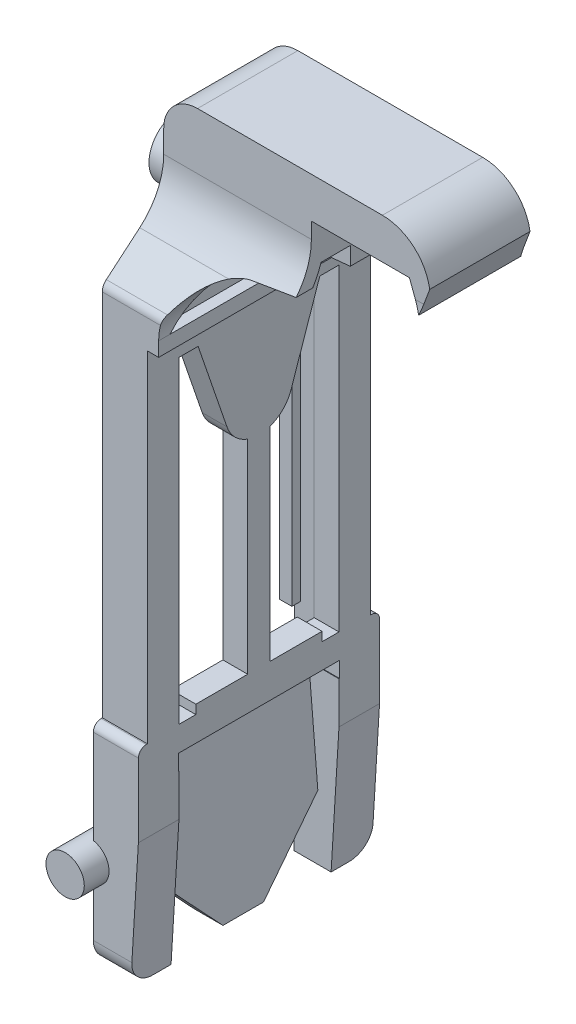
from build123d import *

# Parameters (mm, degrees)
EXTRUSION1_DEPTH        = 10.7
EXTRUSION1_DEPTH_BACK   = 10.7
ESQUISSE2_OUTSIDE_W     = 37.752
ESQUISSE2_OUTSIDE_H     = 80.652
ESQUISSE2_OUTSIDE_W_2   = 14.3
ESQUISSE2_OUTSIDE_H_2   = 1.4
ENL_V_MAT_EXTRU_2_DEPTH = 70.324887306
CONG_1_R                = 3
ESQUISSE3_W             = 15.2
ESQUISSE3_H             = 5
ENL_V_MAT_EXTRU_3_DEPTH = 1.2
ESQUISSE5_W             = 14.25
ESQUISSE5_H             = 31.8
ENL_V_MAT_EXTRU_4_DEPTH = 1.8
EXTRUSION2_START        = 3.45
ESQUISSE4_W             = 1.2
ESQUISSE4_H             = 25
EXTRUSION2_DEPTH        = 1.1
ENL_V_MAT_EXTRU_5_REACH = 70.067
ENL_V_MAT_EXTRU_6_REACH = 72.769
EXTRUSION3_DEPTH        = 12.9
EXTRUSION3_DEPTH_BACK   = 12.9
EXTRUSION3_START        = -10.7
ESQUISSE9_R             = 1.7
ESQUISSE10_R            = 2.8
ESQUISSE10_R_2          = 1.8
EXTRUSION4_DEPTH        = 3
EXTRUSION4_DRAFT        = 1


with BuildPart() as part:
    # Esquisse1 → Extrusion1 (new, two sides: drawn at the far end of the back side and taken through both)
    with BuildSketch(Plane.XY.offset(-EXTRUSION1_DEPTH_BACK)):
        with BuildLine():
            Line((0, 0), (0, 64.3))
            Line((0, 64.3), (19.403071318, 64.3))
            ThreePointArc((19.403071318, 64.3), (22.167768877, 63.276703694), (23.6, 60.7))
            Line((23.6, 60.7), (22.7, 58.3))
            Line((22.7, 58.3), (21.8, 60.7))
            Line((21.8, 60.7), (13.1, 60.7))
            Line((13.1, 60.7), (13.1, 55.5))
            Line((13.1, 55.5), (9.514500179, 55.150195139))
            ThreePointArc((9.514500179, 55.150195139), (6.296791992, 53.533323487), (5, 50.17382197))
            Line((5, 50.17382197), (5, 48.9))
            Line((5, 48.9), (4, 48.9))
            Line((4, 48.9), (4, 11.5))
            Line((4, 11.5), (3.3, 0))
            Line((3.3, 0), (0, 0))
        make_face()
    extrude(amount=EXTRUSION1_DEPTH + EXTRUSION1_DEPTH_BACK)

    # Esquisse2 outside → Enl_v. mat.-Extru.2 (cut, through all)
    # profile 1 of 4: a face of its own
    with BuildSketch(Plane.ZY):
        with Locations((0, 32.15)):
            Rectangle(ESQUISSE2_OUTSIDE_W, ESQUISSE2_OUTSIDE_H)
        with BuildLine():
            Line((-4.45, 64.3), (-4.45, 59.289705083))
            ThreePointArc((-4.45, 59.289705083), (-5.00795982, 56.763007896), (-6.578066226, 54.706242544))
            Line((-6.578066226, 54.706242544), (-9.545322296, 52.199618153))
            ThreePointArc((-9.545322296, 52.199618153), (-9.807006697, 51.856823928), (-9.9, 51.43570773))
            Line((-9.9, 51.43570773), (-9.9, 18.7))
            Line((-9.9, 18.7), (-10, 18.7))
            ThreePointArc((-10, 18.7), (-10.494974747, 18.494974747), (-10.7, 18))
            Line((-10.7, 18), (-10.7, 2))
            ThreePointArc((-10.7, 2), (-10.114213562, 0.585786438), (-8.7, 0))
            Line((-8.7, 0), (-7.1, 0))
            Line((-7.1, 0), (-7.1, 5.7))
            Line((-7.1, 5.7), (-1.8, 0))
            Line((-1.8, 0), (1.8, 0))
            Line((1.8, 0), (7.1, 5.7))
            Line((7.1, 5.7), (7.1, 0))
            Line((7.1, 0), (8.7, 0))
            ThreePointArc((8.7, 0), (10.114213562, 0.585786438), (10.7, 2))
            Line((10.7, 2), (10.7, 18))
            ThreePointArc((10.7, 18), (10.494974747, 18.494974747), (10, 18.7))
            Line((10, 18.7), (9.9, 18.7))
            Line((9.9, 18.7), (9.9, 51.43570773))
            ThreePointArc((9.9, 51.43570773), (9.807006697, 51.856823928), (9.545322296, 52.199618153))
            Line((9.545322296, 52.199618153), (6.578066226, 54.706242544))
            ThreePointArc((6.578066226, 54.706242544), (5.00795982, 56.763007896), (4.45, 59.289705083))
            Line((4.45, 59.289705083), (4.45, 64.3))
            Line((4.45, 64.3), (-4.45, 64.3))
        make_face(mode=Mode.SUBTRACT)
    # profile 2 of 4: a face of its own
    with BuildSketch(Plane.ZY):
        with Locations((0, 15.9)):
            Rectangle(ESQUISSE2_OUTSIDE_W_2, ESQUISSE2_OUTSIDE_H_2)
    # profile 3 of 4: a face of its own
    with BuildSketch(Plane.ZY):
        with BuildLine():
            Line((-7.1, 18.8), (-5.6, 18.8))
            Line((-5.6, 18.8), (-5.6, 19.6))
            Line((-5.6, 19.6), (-1, 19.6))
            Line((-1, 19.6), (-1, 37.671572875))
            ThreePointArc((-1, 37.671572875), (-2.1314144, 38.388821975), (-2.837837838, 39.527027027))
            Line((-2.837837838, 39.527027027), (-5.4, 47))
            Line((-5.4, 47), (-7.1, 47))
            Line((-7.1, 47), (-7.1, 18.8))
        make_face()
    # profile 4 of 4: a face of its own
    with BuildSketch(Plane.ZY):
        with BuildLine():
            Line((5.4, 47), (2.837837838, 39.527027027))
            ThreePointArc((2.837837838, 39.527027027), (2.1314144, 38.388821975), (1, 37.671572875))
            Line((1, 37.671572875), (1, 19.6))
            Line((1, 19.6), (5.6, 19.6))
            Line((5.6, 19.6), (5.6, 18.8))
            Line((5.6, 18.8), (7.1, 18.8))
            Line((7.1, 18.8), (7.1, 47))
            Line((7.1, 47), (5.4, 47))
        make_face()
    extrude(amount=-ENL_V_MAT_EXTRU_2_DEPTH, mode=Mode.SUBTRACT)

    # Cong_1
    cong_1_edges = [part.edges().sort_by_distance(p)[0] for p in [
        (0, 64.3, 0),
    ]]
    fillet(cong_1_edges, radius=CONG_1_R)

    # Esquisse3 → Enl_v. mat.-Extru.3 (cut)
    with BuildSketch(Plane.ZY):
        with Locations((0, 50)):
            Rectangle(ESQUISSE3_W, ESQUISSE3_H)
    extrude(amount=-ENL_V_MAT_EXTRU_3_DEPTH, mode=Mode.SUBTRACT)

    # Esquisse5 → Enl_v. mat.-Extru.4 (cut)
    with BuildSketch(Plane(origin=(0, 0, 0), x_dir=(0, 0, -1), z_dir=(1, 0, 0))):
        with Locations((0.025, 31.1)):
            Rectangle(ESQUISSE5_W, ESQUISSE5_H)
    extrude(amount=ENL_V_MAT_EXTRU_4_DEPTH, mode=Mode.SUBTRACT)

    # Esquisse4 → Extrusion2 (add)
    with BuildSketch(Plane.ZY.offset(-4).offset(EXTRUSION2_START)):
        with Locations((6.975, 31.9)):
            Rectangle(ESQUISSE4_W, ESQUISSE4_H)
        with Locations((-6.975, 31.9)):
            Rectangle(ESQUISSE4_W, ESQUISSE4_H)
    extrude(amount=EXTRUSION2_DEPTH)

    # Enl_v. mat.-Extru.5: up to this face of the body (flat: up to its plane)
    enl_v_mat_extru_5_end = Plane(part.part.faces().sort_by_distance((13.1, 57.990490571, 0))[0])
    # Esquisse6 → Enl_v. mat.-Extru.5 (cut, up to the picked face)
    with BuildSketch(Plane(origin=(4, 0, 0), x_dir=(0, 0, -1), z_dir=(1, 0, 0)), mode=Mode.PRIVATE) as enl_v_mat_extru_5_sk1:
        with BuildLine():
            Line((-8.9, 50.17382197), (-0.999461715, 50.17382197))
            Line((-0.999461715, 50.17382197), (-0.999461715, 57.1))
            Line((-0.999461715, 57.1), (-3.591050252, 57.1))
            ThreePointArc((-3.591050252, 57.1), (-4.118776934, 55.861058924), (-4.867982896, 54.742058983))
            ThreePointArc((-4.867982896, 54.742058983), (-5.048917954, 54.52857993), (-5.238012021, 54.322293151))
            ThreePointArc((-5.238012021, 54.322293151), (-5.9346344, 53.493183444), (-6.747726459, 52.777930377))
            Line((-6.747726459, 52.777930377), (-8.9, 50.17382197))
        make_face()
    enl_v_mat_extru_5_tool1 = split(extrude(enl_v_mat_extru_5_sk1.sketch, amount=ENL_V_MAT_EXTRU_5_REACH, mode=Mode.PRIVATE), bisect_by=enl_v_mat_extru_5_end, keep=Keep.BOTH, mode=Mode.PRIVATE)
    # Esquisse6 → Enl_v. mat.-Extru.5 (cut, up to the picked face)
    with BuildSketch(Plane(origin=(4, 0, 0), x_dir=(0, 0, -1), z_dir=(1, 0, 0)), mode=Mode.PRIVATE) as enl_v_mat_extru_5_sk2:
        with BuildLine():
            Line((0.999461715, 57.1), (0.999461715, 50.17382197))
            Line((0.999461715, 50.17382197), (8.9, 50.17382197))
            Line((8.9, 50.17382197), (6.747726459, 52.777930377))
            ThreePointArc((6.747726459, 52.777930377), (5.9346344, 53.493183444), (5.238012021, 54.322293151))
            ThreePointArc((5.238012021, 54.322293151), (5.048917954, 54.52857993), (4.867982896, 54.742058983))
            ThreePointArc((4.867982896, 54.742058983), (4.118776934, 55.861058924), (3.591050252, 57.1))
            Line((3.591050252, 57.1), (0.999461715, 57.1))
        make_face()
    enl_v_mat_extru_5_tool2 = split(extrude(enl_v_mat_extru_5_sk2.sketch, amount=ENL_V_MAT_EXTRU_5_REACH, mode=Mode.PRIVATE), bisect_by=enl_v_mat_extru_5_end, keep=Keep.BOTH, mode=Mode.PRIVATE)
    add(enl_v_mat_extru_5_tool1.solids().sort_by(Axis((4, 52.976172, 3.760794), (1, 0, 0)))[0], mode=Mode.SUBTRACT)
    add(enl_v_mat_extru_5_tool2.solids().sort_by(Axis((4, 52.976172, -3.760794), (1, 0, 0)))[0], mode=Mode.SUBTRACT)

    # Enl_v. mat.-Extru.6: up to this face of the body (flat: up to its plane)
    enl_v_mat_extru_6_end = Plane(part.part.faces().sort_by_distance((1.738183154, 2.897446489, -7.1))[0])
    # Esquisse7 → Enl_v. mat.-Extru.6 (cut, up to the picked face)
    with BuildSketch(Plane(origin=(0, 0, 7.1), x_dir=(-1, 0, 0), z_dir=(0, 0, -1)), mode=Mode.PRIVATE) as enl_v_mat_extru_6_sk1:
        Polygon((-2.60626235, 0), (-1.321432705, 15.2), (-4, 15.2), (-4, 11.5), (-3.3, 0), align=None)
    enl_v_mat_extru_6_tool1 = split(extrude(enl_v_mat_extru_6_sk1.sketch, amount=ENL_V_MAT_EXTRU_6_REACH, mode=Mode.PRIVATE), bisect_by=enl_v_mat_extru_6_end, keep=Keep.BOTH, mode=Mode.PRIVATE)
    add(enl_v_mat_extru_6_tool1.solids().sort_by(Axis((2.82578, 9.08185, 7.1), (0, 0, -1)))[0], mode=Mode.SUBTRACT)

    # Esquisse9 → Extrusion3 (add, two sides: drawn at the far end of the back side and taken through both)
    with BuildSketch(Plane.XY.offset(10.7).offset(EXTRUSION3_START - EXTRUSION3_DEPTH_BACK)):
        with Locations((-0.3, 8)):
            Circle(ESQUISSE9_R)
    extrude(amount=EXTRUSION3_DEPTH + EXTRUSION3_DEPTH_BACK)


with BuildPart() as extrusion4_tool:
    # Esquisse10 → Extrusion4 (with draft: the straight prism first)
    with BuildSketch(Plane.ZY):
        with Locations((0.012219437, 56.3)):
            Circle(ESQUISSE10_R)
        with Locations((0.012219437, 56.3)):
            Circle(ESQUISSE10_R_2, mode=Mode.SUBTRACT)
    extrude(amount=EXTRUSION4_DEPTH)
    # Extrusion4: the draft: its side faces are tilted about the plane it starts from
    extrusion4_sides = [extrusion4_tool.faces().sort_by_distance(p)[0] for p in [
        (-1.5, 56.3, -2.787780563),
        (-1.5, 56.3, -1.787780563),
    ]]
    draft(extrusion4_sides, Plane.ZY, EXTRUSION4_DRAFT)


with BuildPart() as part_1:
    add(part.part)

    # Extrusion4: add extrusion4_tool
    add(extrusion4_tool.part)


solid = part_1.part
